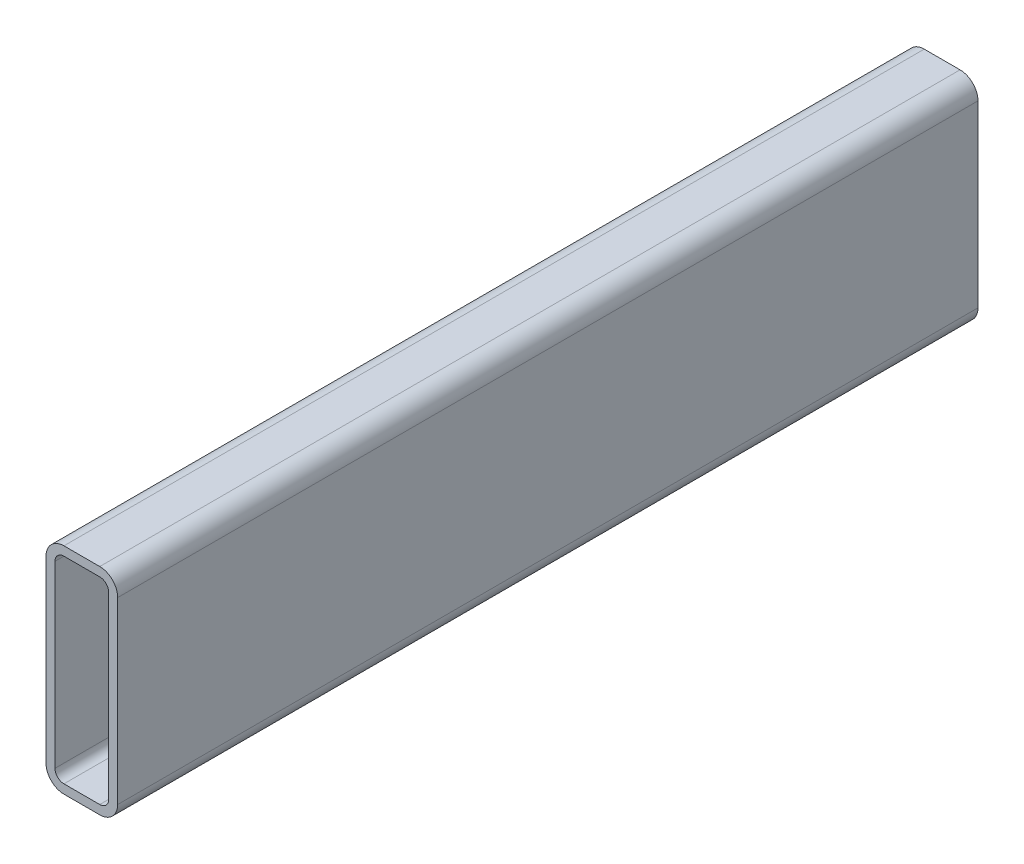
from build123d import *

# Parameters (mm, degrees)
BOSS_EXTRUDE1_DEPTH = 304.8


with BuildPart() as part:
    # Sketch1 → Boss-Extrude1 (new body)
    with BuildSketch(Plane.XY):
        with BuildLine():
            Line((6.35, 76.2), (19.05, 76.2))
            ThreePointArc((19.05, 76.2), (23.540128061, 74.340128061), (25.4, 69.85))
            Line((25.4, 69.85), (25.4, 6.35))
            ThreePointArc((25.4, 6.35), (23.540128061, 1.859871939), (19.05, 0))
            Line((19.05, 0), (6.35, 0))
            ThreePointArc((6.35, 0), (1.859871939, 1.859871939), (0, 6.35))
            Line((0, 6.35), (0, 69.85))
            ThreePointArc((0, 69.85), (1.859871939, 74.340128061), (6.35, 76.2))
        make_face()
        with BuildLine():
            Line((6.35, 73.025), (19.05, 73.025))
            ThreePointArc((19.05, 73.025), (21.29506403, 72.09506403), (22.225, 69.85))
            Line((22.225, 69.85), (22.225, 6.35))
            ThreePointArc((22.225, 6.35), (21.29506403, 4.10493597), (19.05, 3.175))
            Line((19.05, 3.175), (6.35, 3.175))
            ThreePointArc((6.35, 3.175), (4.10493597, 4.10493597), (3.175, 6.35))
            Line((3.175, 6.35), (3.175, 69.85))
            ThreePointArc((3.175, 69.85), (4.10493597, 72.09506403), (6.35, 73.025))
        make_face(mode=Mode.SUBTRACT)
    extrude(amount=BOSS_EXTRUDE1_DEPTH)


solid = part.part
